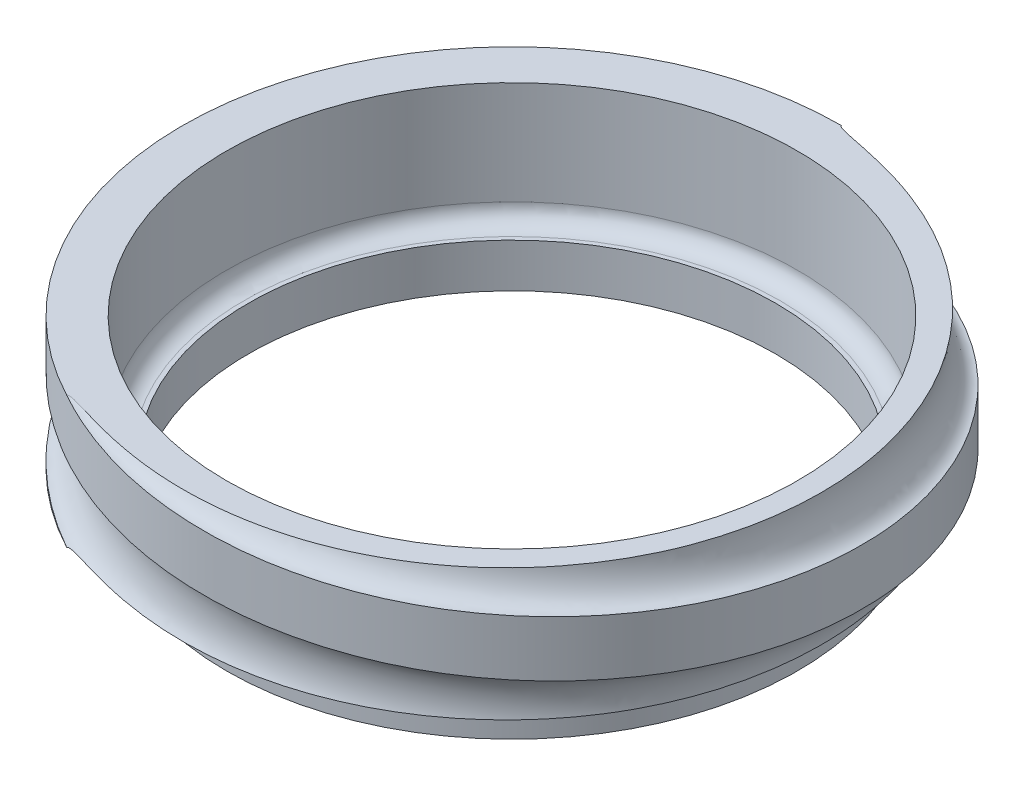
from build123d import *

# Parameters (mm, degrees)
SKETCH1_R              = 41.275
BOSS_EXTRUDE1_DEPTH    = 4.7625
SKETCH2_R              = 47.625
BOSS_EXTRUDE2_DEPTH    = 19.05
SKETCH3_R              = 38.1
CUT_EXTRUDE1_DEPTH     = 72.4375
SKETCH6_R              = 41.275
CUT_EXTRUDE2_DEPTH     = 17.4625
CUT_SWEEP1_PITCH       = 19.05
CUT_SWEEP1_HEIGHT      = 95.25
CUT_SWEEP1_RADIUS      = 47.625
CUT_SWEEP1_START_ANGLE = 180
SKETCH11_RX            = 5.500000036
SKETCH11_RY            = 3.175
FILLET1_R              = 2.54


with BuildPart() as part:
    # Sketch1 → Boss-Extrude1 (new body)
    with BuildSketch(Plane(origin=(0, 0, 0), x_dir=(1, 0, 0), z_dir=(0, 1, 0))):
        with Locations(Location((0, 0, 0), (0, 0, 270))):
            Circle(SKETCH1_R)
    extrude(amount=-BOSS_EXTRUDE1_DEPTH)

    # Sketch2 → Boss-Extrude2 (add)
    with BuildSketch(Plane(origin=(0, 0, 0), x_dir=(1, 0, 0), z_dir=(0, 1, 0))):
        with Locations(Location((0, 0, 0), (0, 0, 90))):
            Circle(SKETCH2_R)
    extrude(amount=BOSS_EXTRUDE2_DEPTH)

    # Sketch3 → Cut-Extrude1 (cut, through all)
    with BuildSketch(Plane.XZ.offset(4.7625)):
        with Locations(Location((0, 0, 0), (0, 0, 270))):
            Circle(SKETCH3_R)
    extrude(amount=-CUT_EXTRUDE1_DEPTH, mode=Mode.SUBTRACT)

    # Sketch6 → Cut-Extrude2 (cut)
    with BuildSketch(Plane(origin=(0, 19.05, 0), x_dir=(1, 0, 0), z_dir=(0, 1, 0))):
        with Locations(Location((0, 0, 0), (0, 0, 270))):
            Circle(SKETCH6_R)
    extrude(amount=-CUT_EXTRUDE2_DEPTH, mode=Mode.SUBTRACT)

    # Cut-Sweep1: sweep along a helix
    with BuildLine() as cut_sweep1_path:
        add(Helix(CUT_SWEEP1_PITCH, CUT_SWEEP1_HEIGHT, CUT_SWEEP1_RADIUS, center=(0, 0, 0), direction=(0, 1, 0), lefthand=True, mode=Mode.PRIVATE).rotate(Axis((0, 0, 0), (0, 1, 0)), CUT_SWEEP1_START_ANGLE))
    # Sketch11 → Cut-Sweep1 (sweep, cut)
    with BuildSketch(Plane(origin=(0, 0, 0), x_dir=(0, 0, -1), z_dir=(1, 0, 0))):
        with Locations(Location((47.625, -5.500000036), (0, 0, -90))):
            Ellipse(SKETCH11_RX, SKETCH11_RY)
    sweep(path=cut_sweep1_path.line, is_frenet=True, mode=Mode.SUBTRACT)

    # Fillet1
    fillet1_edges = [part.edges().sort_by_distance(p)[0] for p in [
        (0, 1.5875, -41.275),
    ]]
    fillet(fillet1_edges, radius=FILLET1_R)


solid = part.part
